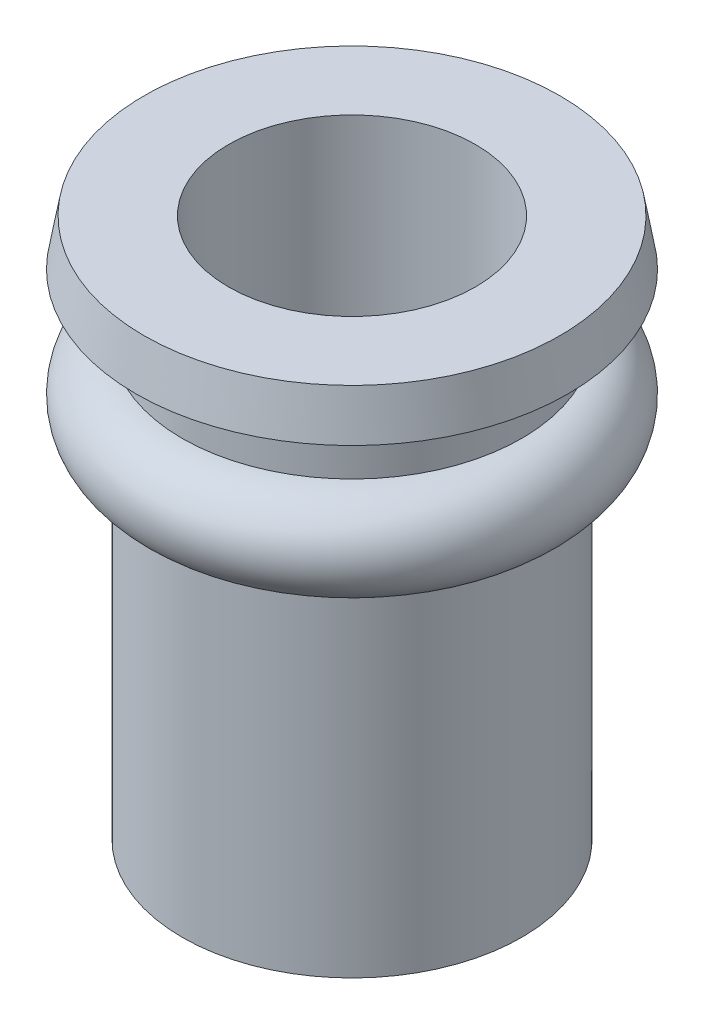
from build123d import *

# Parameters (mm, degrees)
SKIZZE2_R                       = 4
SCHNITT_LINEAR_AUSTRAGEN2_DEPTH = 21.105969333


with BuildPart() as part:
    # Skizze1 → Basis-Rotation (revolve)
    with BuildSketch(Plane.XY, mode=Mode.PRIVATE) as basis_rotation_sk:
        with BuildLine():
            Line((6.735509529, 17.5), (0, 17.5))
            Line((0, 17.5), (0, 0))
            Line((0, 0), (5.5, 0))
            Line((5.5, 0), (5.5, 11))
            ThreePointArc((5.5, 11), (7, 12.5), (5.5, 14))
            Line((5.5, 14), (5.5, 16))
            Line((5.5, 16), (7, 16))
            Line((7, 16), (6.735509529, 17.5))
        make_face()
    revolve(basis_rotation_sk.sketch.rotate(Axis((0, 38.953460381, 0), (0, -1, 0)), 90), axis=Axis((0, 38.953460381, 0), (0, -1, 0)))

    # Skizze2 → Schnitt-Linear austragen2 (cut, through all)
    with BuildSketch(Plane.XZ):
        with Locations(Location((0, 0, 0), (0, 0, 270))):
            Circle(SKIZZE2_R)
    extrude(amount=-SCHNITT_LINEAR_AUSTRAGEN2_DEPTH, mode=Mode.SUBTRACT)


solid = part.part
